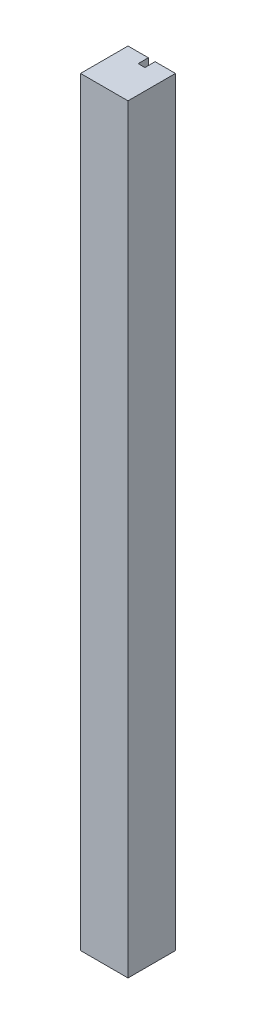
from build123d import *

# Parameters (mm, degrees)
BOSS_EXTRUDE1_DEPTH = 1422.4


with BuildPart() as part:
    # Sketch1 → Boss-Extrude1 (new body)
    with BuildSketch(Plane(origin=(0, 0, 0), x_dir=(1, 0, 0), z_dir=(0, 1, 0))):
        Polygon((-6.35, 44.45), (-44.45, 44.45), (-44.45, -44.45), (44.45, -44.45), (44.45, 44.45), (6.35, 44.45), (6.35, 25.4), (-6.35, 25.4), align=None)
    extrude(amount=BOSS_EXTRUDE1_DEPTH)


solid = part.part
